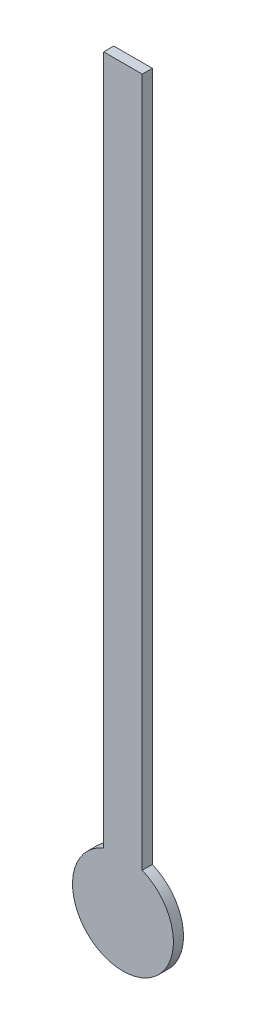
from build123d import *

# Parameters (mm, degrees)
LINEAR_AUSTRAGEN1_DEPTH = 1


with BuildPart() as part:
    # Skizze1 → Linear austragen1 (new body)
    with BuildSketch(Plane.XY):
        with BuildLine():
            Line((-1.91230977, 4.619856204), (-1.91230977, 72.984552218))
            Line((-1.91230977, 72.984552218), (1.91230977, 72.984552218))
            Line((1.91230977, 72.984552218), (1.91230977, 4.619856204))
            ThreePointArc((1.91230977, 4.619856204), (0, -5), (-1.91230977, 4.619856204))
        make_face()
    extrude(amount=LINEAR_AUSTRAGEN1_DEPTH)


solid = part.part
